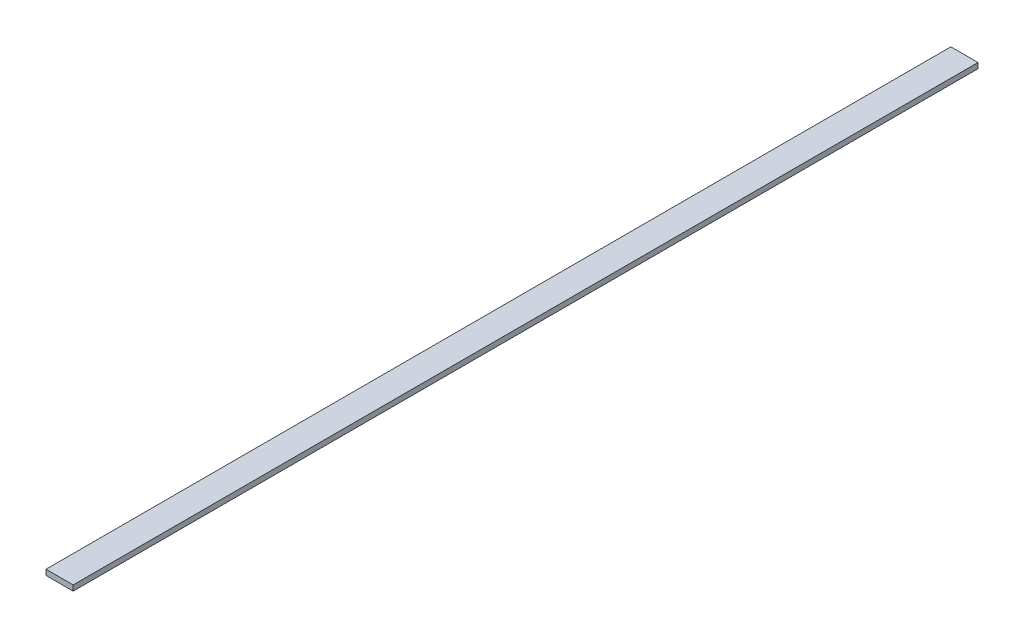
ISO-10303-21;
HEADER;
FILE_DESCRIPTION(('STEP AP214'),'2;1');
FILE_NAME('part.step','',(''),(''),'','','');
FILE_SCHEMA(('AUTOMOTIVE_DESIGN { 1 0 10303 214 1 1 1 1 }'));
ENDSEC;
DATA;
#1=APPLICATION_CONTEXT('core data for automotive mechanical design processes');
#2=APPLICATION_PROTOCOL_DEFINITION('international standard','automotive_design',2000,#1);
#3=PRODUCT_CONTEXT('',#1,'mechanical');
#4=PRODUCT('Part','Part','',(#3));
#5=PRODUCT_RELATED_PRODUCT_CATEGORY('part','',(#4));
#6=PRODUCT_DEFINITION_FORMATION('','',#4);
#7=PRODUCT_DEFINITION_CONTEXT('part definition',#1,'design');
#8=PRODUCT_DEFINITION('design','',#6,#7);
#9=PRODUCT_DEFINITION_SHAPE('','',#8);
#10=(LENGTH_UNIT() NAMED_UNIT(*) SI_UNIT(.MILLI.,.METRE.));
#11=(NAMED_UNIT(*) PLANE_ANGLE_UNIT() SI_UNIT($,.RADIAN.));
#12=(NAMED_UNIT(*) SI_UNIT($,.STERADIAN.) SOLID_ANGLE_UNIT());
#13=UNCERTAINTY_MEASURE_WITH_UNIT(LENGTH_MEASURE(1.E-05),#10,'distance_accuracy_value','');
#14=(GEOMETRIC_REPRESENTATION_CONTEXT(3) GLOBAL_UNCERTAINTY_ASSIGNED_CONTEXT((#13)) GLOBAL_UNIT_ASSIGNED_CONTEXT((#10,
#11,#12)) REPRESENTATION_CONTEXT('',''));
#15=CARTESIAN_POINT('',(0.,0.,0.));
#16=DIRECTION('',(0.,0.,1.));
#17=DIRECTION('',(1.,0.,0.));
#18=AXIS2_PLACEMENT_3D('',#15,#16,#17);
#19=CARTESIAN_POINT('',(7.5,0.,0.));
#20=DIRECTION('',(-1.,0.,0.));
#21=DIRECTION('',(0.,0.,1.));
#22=AXIS2_PLACEMENT_3D('',#19,#20,#21);
#23=PLANE('',#22);
#24=DIRECTION('',(0.,-1.,0.));
#25=VECTOR('',#24,1.);
#26=CARTESIAN_POINT('',(7.5,1.5,0.));
#27=LINE('',#26,#25);
#28=CARTESIAN_POINT('',(7.5,3.,0.));
#29=VERTEX_POINT('',#28);
#30=CARTESIAN_POINT('',(7.5,0.,0.));
#31=VERTEX_POINT('',#30);
#32=EDGE_CURVE('E51',#29,#31,#27,.T.);
#33=ORIENTED_EDGE('',*,*,#32,.F.);
#34=DIRECTION('',(0.,0.,-1.));
#35=VECTOR('',#34,1.);
#36=CARTESIAN_POINT('',(7.5,3.,250.));
#37=LINE('',#36,#35);
#38=CARTESIAN_POINT('',(7.5,3.,500.));
#39=VERTEX_POINT('',#38);
#40=EDGE_CURVE('E66',#39,#29,#37,.T.);
#41=ORIENTED_EDGE('',*,*,#40,.F.);
#42=DIRECTION('',(0.,-1.,0.));
#43=VECTOR('',#42,1.);
#44=CARTESIAN_POINT('',(7.5,1.5,500.));
#45=LINE('',#44,#43);
#46=CARTESIAN_POINT('',(7.5,0.,500.));
#47=VERTEX_POINT('',#46);
#48=EDGE_CURVE('E18',#39,#47,#45,.T.);
#49=ORIENTED_EDGE('',*,*,#48,.T.);
#50=DIRECTION('',(0.,0.,1.));
#51=VECTOR('',#50,1.);
#52=CARTESIAN_POINT('',(7.5,0.,250.));
#53=LINE('',#52,#51);
#54=EDGE_CURVE('E56',#31,#47,#53,.T.);
#55=ORIENTED_EDGE('',*,*,#54,.F.);
#56=EDGE_LOOP('',(#33,#41,#49,#55));
#57=FACE_BOUND('',#56,.T.);
#58=ADVANCED_FACE('F14',(#57),#23,.F.);
#59=CARTESIAN_POINT('',(7.5,0.,500.));
#60=DIRECTION('',(0.,0.,-1.));
#61=DIRECTION('',(-1.,0.,0.));
#62=AXIS2_PLACEMENT_3D('',#59,#60,#61);
#63=PLANE('',#62);
#64=DIRECTION('',(-1.,0.,0.));
#65=VECTOR('',#64,1.);
#66=CARTESIAN_POINT('',(0.,0.,500.));
#67=LINE('',#66,#65);
#68=CARTESIAN_POINT('',(-7.5,0.,500.));
#69=VERTEX_POINT('',#68);
#70=EDGE_CURVE('E61',#47,#69,#67,.T.);
#71=ORIENTED_EDGE('',*,*,#70,.F.);
#72=ORIENTED_EDGE('',*,*,#48,.F.);
#73=DIRECTION('',(1.,0.,0.));
#74=VECTOR('',#73,1.);
#75=CARTESIAN_POINT('',(0.,3.,500.));
#76=LINE('',#75,#74);
#77=CARTESIAN_POINT('',(-7.5,3.,500.));
#78=VERTEX_POINT('',#77);
#79=EDGE_CURVE('E79',#78,#39,#76,.T.);
#80=ORIENTED_EDGE('',*,*,#79,.F.);
#81=DIRECTION('',(0.,-1.,0.));
#82=VECTOR('',#81,1.);
#83=CARTESIAN_POINT('',(-7.5,1.5,500.));
#84=LINE('',#83,#82);
#85=EDGE_CURVE('E72',#78,#69,#84,.T.);
#86=ORIENTED_EDGE('',*,*,#85,.T.);
#87=EDGE_LOOP('',(#71,#72,#80,#86));
#88=FACE_BOUND('',#87,.T.);
#89=ADVANCED_FACE('F71',(#88),#63,.F.);
#90=CARTESIAN_POINT('',(-7.5,0.,500.));
#91=DIRECTION('',(0.,-1.,0.));
#92=DIRECTION('',(0.,0.,-1.));
#93=AXIS2_PLACEMENT_3D('',#90,#91,#92);
#94=PLANE('',#93);
#95=ORIENTED_EDGE('',*,*,#70,.T.);
#96=DIRECTION('',(0.,0.,-1.));
#97=VECTOR('',#96,1.);
#98=CARTESIAN_POINT('',(-7.5,0.,250.));
#99=LINE('',#98,#97);
#100=CARTESIAN_POINT('',(-7.5,0.,0.));
#101=VERTEX_POINT('',#100);
#102=EDGE_CURVE('E82',#69,#101,#99,.T.);
#103=ORIENTED_EDGE('',*,*,#102,.T.);
#104=DIRECTION('',(-1.,0.,0.));
#105=VECTOR('',#104,1.);
#106=CARTESIAN_POINT('',(0.,0.,0.));
#107=LINE('',#106,#105);
#108=EDGE_CURVE('E63',#31,#101,#107,.T.);
#109=ORIENTED_EDGE('',*,*,#108,.F.);
#110=ORIENTED_EDGE('',*,*,#54,.T.);
#111=EDGE_LOOP('',(#95,#103,#109,#110));
#112=FACE_BOUND('',#111,.T.);
#113=ADVANCED_FACE('F58',(#112),#94,.T.);
#114=CARTESIAN_POINT('',(7.5,0.,0.));
#115=DIRECTION('',(0.,0.,-1.));
#116=DIRECTION('',(-1.,0.,0.));
#117=AXIS2_PLACEMENT_3D('',#114,#115,#116);
#118=PLANE('',#117);
#119=ORIENTED_EDGE('',*,*,#32,.T.);
#120=ORIENTED_EDGE('',*,*,#108,.T.);
#121=DIRECTION('',(0.,1.,0.));
#122=VECTOR('',#121,1.);
#123=CARTESIAN_POINT('',(-7.5,1.5,0.));
#124=LINE('',#123,#122);
#125=CARTESIAN_POINT('',(-7.5,3.,0.));
#126=VERTEX_POINT('',#125);
#127=EDGE_CURVE('E24',#101,#126,#124,.T.);
#128=ORIENTED_EDGE('',*,*,#127,.T.);
#129=DIRECTION('',(-1.,0.,0.));
#130=VECTOR('',#129,1.);
#131=CARTESIAN_POINT('',(0.,3.,0.));
#132=LINE('',#131,#130);
#133=EDGE_CURVE('E32',#29,#126,#132,.T.);
#134=ORIENTED_EDGE('',*,*,#133,.F.);
#135=EDGE_LOOP('',(#119,#120,#128,#134));
#136=FACE_BOUND('',#135,.T.);
#137=ADVANCED_FACE('F86',(#136),#118,.T.);
#138=CARTESIAN_POINT('',(7.5,3.,0.));
#139=DIRECTION('',(0.,1.,0.));
#140=DIRECTION('',(-1.,0.,0.));
#141=AXIS2_PLACEMENT_3D('',#138,#139,#140);
#142=PLANE('',#141);
#143=DIRECTION('',(0.,0.,1.));
#144=VECTOR('',#143,1.);
#145=CARTESIAN_POINT('',(-7.5,3.,250.));
#146=LINE('',#145,#144);
#147=EDGE_CURVE('E9',#126,#78,#146,.T.);
#148=ORIENTED_EDGE('',*,*,#147,.T.);
#149=ORIENTED_EDGE('',*,*,#79,.T.);
#150=ORIENTED_EDGE('',*,*,#40,.T.);
#151=ORIENTED_EDGE('',*,*,#133,.T.);
#152=EDGE_LOOP('',(#148,#149,#150,#151));
#153=FACE_BOUND('',#152,.T.);
#154=ADVANCED_FACE('F88',(#153),#142,.T.);
#155=CARTESIAN_POINT('',(-7.5,0.,500.));
#156=DIRECTION('',(1.,0.,0.));
#157=DIRECTION('',(0.,0.,-1.));
#158=AXIS2_PLACEMENT_3D('',#155,#156,#157);
#159=PLANE('',#158);
#160=ORIENTED_EDGE('',*,*,#127,.F.);
#161=ORIENTED_EDGE('',*,*,#102,.F.);
#162=ORIENTED_EDGE('',*,*,#85,.F.);
#163=ORIENTED_EDGE('',*,*,#147,.F.);
#164=EDGE_LOOP('',(#160,#161,#162,#163));
#165=FACE_BOUND('',#164,.T.);
#166=ADVANCED_FACE('F16',(#165),#159,.F.);
#167=CLOSED_SHELL('',(#58,#89,#113,#137,#154,#166));
#168=MANIFOLD_SOLID_BREP('B1',#167);
#169=ADVANCED_BREP_SHAPE_REPRESENTATION('',(#18,#168),#14);
#170=SHAPE_DEFINITION_REPRESENTATION(#9,#169);
ENDSEC;
END-ISO-10303-21;
